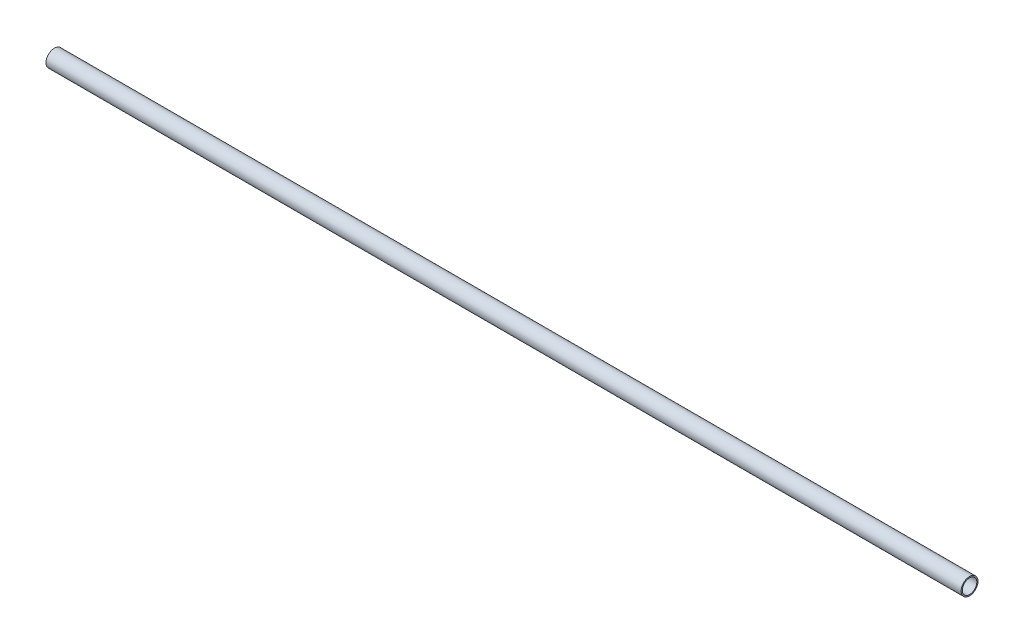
from build123d import *

# Parameters (mm, degrees)
SKETCH1_R           = 7
SKETCH1_R_2         = 6
BOSS_EXTRUDE1_DEPTH = 380


with BuildPart() as part:
    # Sketch1 → Boss-Extrude1 (new, symmetric)
    with BuildSketch(Plane(origin=(0, 0, 0), x_dir=(0, 0, -1), z_dir=(1, 0, 0))):
        Circle(SKETCH1_R)
        Circle(SKETCH1_R_2, mode=Mode.SUBTRACT)
    extrude(amount=BOSS_EXTRUDE1_DEPTH, both=True)


solid = part.part
